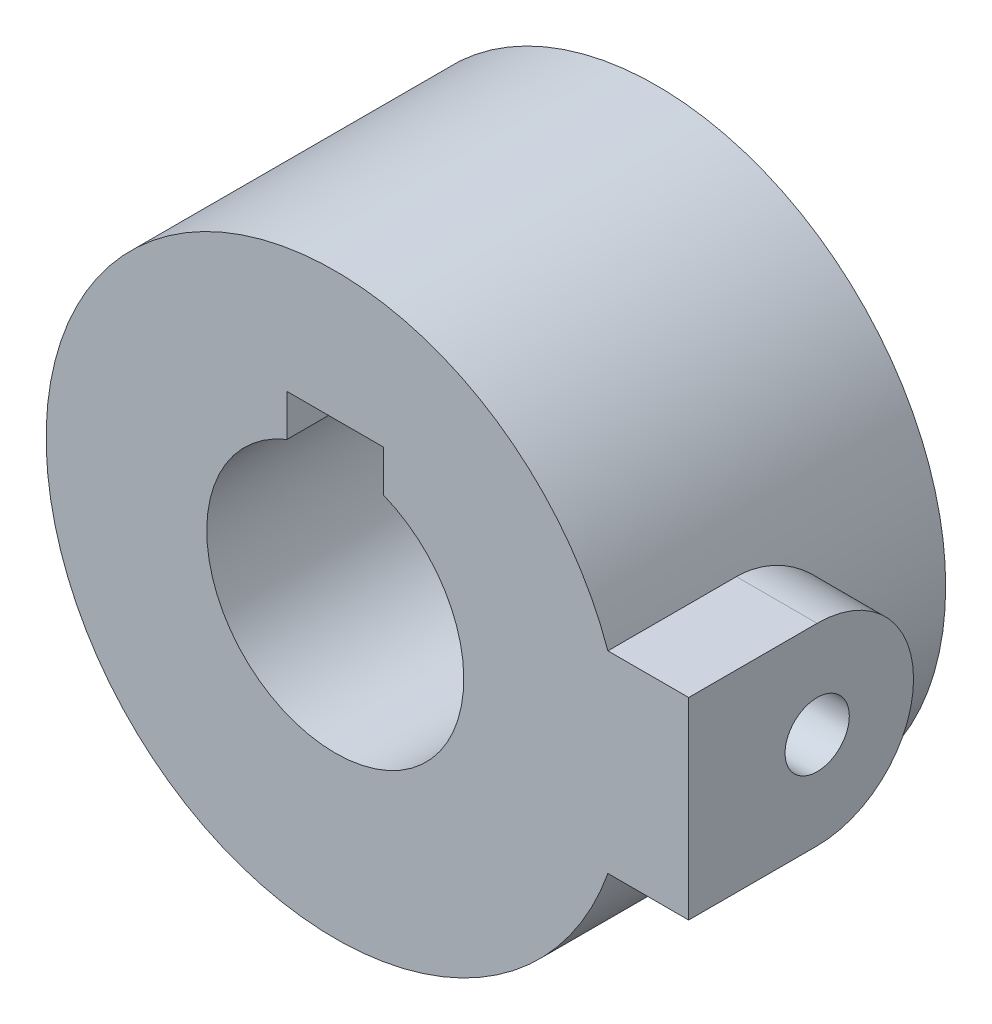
from build123d import *

# Parameters (mm, degrees)
SKETCH_1_R           = 18
EXTRUDE_1_DEPTH      = 20
EXTRUDE_2_REACH      = 50.208
EXTRUDE_2_END_RADIUS = 18
SKETCH_2_R           = 2


with BuildPart() as part:
    # Sketch 1 → Extrude 1 (new body)
    with BuildSketch(Plane.XY):
        Circle(SKETCH_1_R)
        with BuildLine():
            Line((-3, 7.416198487), (-3, 10))
            Line((-3, 10), (3, 10))
            Line((3, 10), (3, 7.416198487))
            ThreePointArc((3, 7.416198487), (0, -8), (-3, 7.416198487))
        make_face(mode=Mode.SUBTRACT)
    extrude(amount=EXTRUDE_1_DEPTH)

    # Extrude 2: up to this cylinder (the profile starts outside it)
    extrude_2_end = Plane(origin=(0, 0, 6.184391), z_dir=(0, 0, -1)) * Cylinder(EXTRUDE_2_END_RADIUS, 137.416, mode=Mode.PRIVATE)
    # Sketch 2 → Extrude 2 (add, up to the surface)
    with BuildSketch(Plane(origin=(22, 0, 0), x_dir=(0, 0, -1), z_dir=(1, 0, 0)), mode=Mode.PRIVATE) as extrude_2_sk1:
        with BuildLine():
            Line((-12, 6), (-20, 6))
            Line((-20, 6), (-20, -6))
            Line((-20, -6), (-12, -6))
            ThreePointArc((-12, -6), (-6, 0), (-12, 6))
        make_face()
        with Locations((-12, 0)):
            Circle(SKETCH_2_R, mode=Mode.SUBTRACT)
    extrude_2_tool1 = extrude(extrude_2_sk1.sketch, amount=-EXTRUDE_2_REACH, mode=Mode.PRIVATE) - extrude_2_end
    add(extrude_2_tool1.solids().sort_by_distance((22, 0, 6.184391))[0])


solid = part.part
